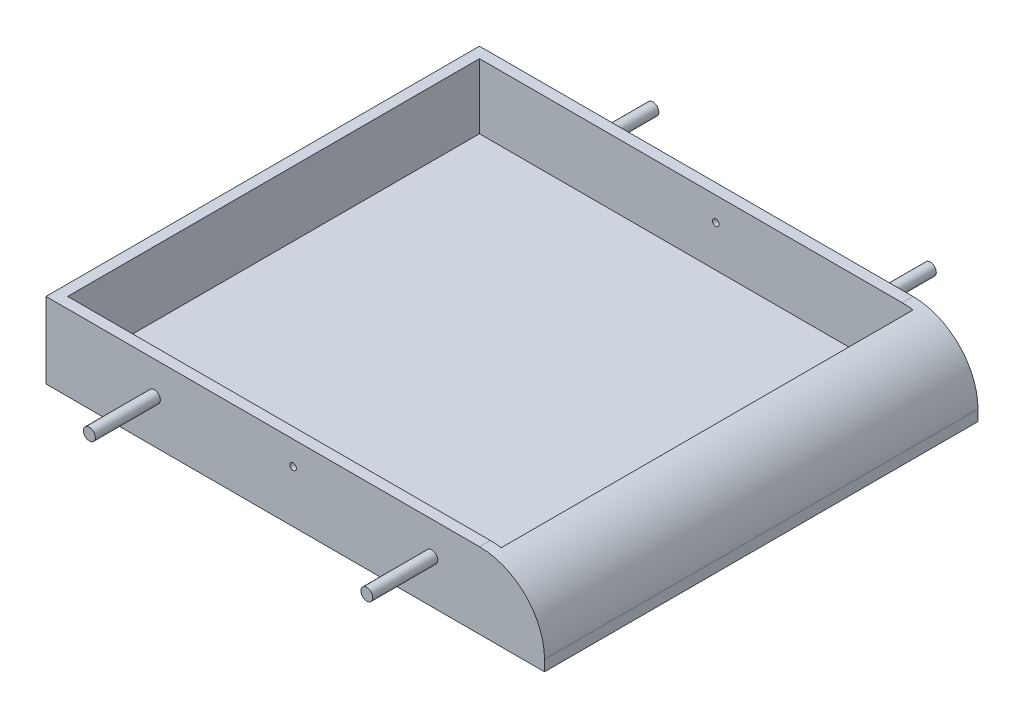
ISO-10303-21;
HEADER;
FILE_DESCRIPTION(('STEP AP214'),'2;1');
FILE_NAME('part.step','',(''),(''),'','','');
FILE_SCHEMA(('AUTOMOTIVE_DESIGN { 1 0 10303 214 1 1 1 1 }'));
ENDSEC;
DATA;
#1=APPLICATION_CONTEXT('core data for automotive mechanical design processes');
#2=APPLICATION_PROTOCOL_DEFINITION('international standard','automotive_design',2000,#1);
#3=PRODUCT_CONTEXT('',#1,'mechanical');
#4=PRODUCT('Part','Part','',(#3));
#5=PRODUCT_RELATED_PRODUCT_CATEGORY('part','',(#4));
#6=PRODUCT_DEFINITION_FORMATION('','',#4);
#7=PRODUCT_DEFINITION_CONTEXT('part definition',#1,'design');
#8=PRODUCT_DEFINITION('design','',#6,#7);
#9=PRODUCT_DEFINITION_SHAPE('','',#8);
#10=(LENGTH_UNIT() NAMED_UNIT(*) SI_UNIT(.MILLI.,.METRE.));
#11=(NAMED_UNIT(*) PLANE_ANGLE_UNIT() SI_UNIT($,.RADIAN.));
#12=(NAMED_UNIT(*) SI_UNIT($,.STERADIAN.) SOLID_ANGLE_UNIT());
#13=UNCERTAINTY_MEASURE_WITH_UNIT(LENGTH_MEASURE(1.E-05),#10,'distance_accuracy_value','');
#14=(GEOMETRIC_REPRESENTATION_CONTEXT(3) GLOBAL_UNCERTAINTY_ASSIGNED_CONTEXT((#13)) GLOBAL_UNIT_ASSIGNED_CONTEXT((#10,
#11,#12)) REPRESENTATION_CONTEXT('',''));
#15=CARTESIAN_POINT('',(0.,0.,0.));
#16=DIRECTION('',(0.,0.,1.));
#17=DIRECTION('',(1.,0.,0.));
#18=AXIS2_PLACEMENT_3D('',#15,#16,#17);
#19=CARTESIAN_POINT('',(-230.,5.,0.));
#20=DIRECTION('',(0.,0.,-1.));
#21=DIRECTION('',(-1.,0.,0.));
#22=AXIS2_PLACEMENT_3D('',#19,#20,#21);
#23=PLANE('',#22);
#24=CARTESIAN_POINT('',(-116.,24.,0.));
#25=DIRECTION('',(0.,0.,-1.));
#26=DIRECTION('',(-1.,0.,0.));
#27=AXIS2_PLACEMENT_3D('',#24,#25,#26);
#28=CIRCLE('',#27,1.5);
#29=CARTESIAN_POINT('',(-117.5,24.,0.));
#30=VERTEX_POINT('',#29);
#31=EDGE_CURVE('E273',#30,#30,#28,.T.);
#32=ORIENTED_EDGE('',*,*,#31,.T.);
#33=EDGE_LOOP('',(#32));
#34=FACE_BOUND('',#33,.T.);
#35=CARTESIAN_POINT('',(-180.,20.,0.));
#36=DIRECTION('',(0.,0.,-1.));
#37=DIRECTION('',(-1.,0.,0.));
#38=AXIS2_PLACEMENT_3D('',#35,#36,#37);
#39=CIRCLE('',#38,2.75000000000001);
#40=CARTESIAN_POINT('',(-182.75,20.,0.));
#41=VERTEX_POINT('',#40);
#42=EDGE_CURVE('E258',#41,#41,#39,.T.);
#43=ORIENTED_EDGE('',*,*,#42,.T.);
#44=EDGE_LOOP('',(#43));
#45=FACE_BOUND('',#44,.T.);
#46=CARTESIAN_POINT('',(-52.,20.,0.));
#47=DIRECTION('',(0.,0.,-1.));
#48=DIRECTION('',(-1.,0.,0.));
#49=AXIS2_PLACEMENT_3D('',#46,#47,#48);
#50=CIRCLE('',#49,2.75);
#51=CARTESIAN_POINT('',(-54.75,20.,0.));
#52=VERTEX_POINT('',#51);
#53=EDGE_CURVE('E163',#52,#52,#50,.T.);
#54=ORIENTED_EDGE('',*,*,#53,.T.);
#55=EDGE_LOOP('',(#54));
#56=FACE_BOUND('',#55,.T.);
#57=DIRECTION('',(0.,-1.,0.));
#58=VECTOR('',#57,1.);
#59=CARTESIAN_POINT('',(0.,5.,0.));
#60=LINE('',#59,#58);
#61=CARTESIAN_POINT('',(0.,5.,0.));
#62=VERTEX_POINT('',#61);
#63=CARTESIAN_POINT('',(0.,0.,0.));
#64=VERTEX_POINT('',#63);
#65=EDGE_CURVE('E214',#62,#64,#60,.T.);
#66=ORIENTED_EDGE('',*,*,#65,.F.);
#67=CARTESIAN_POINT('',(-30.,5.,0.));
#68=DIRECTION('',(0.,0.,-1.));
#69=DIRECTION('',(-1.,0.,0.));
#70=AXIS2_PLACEMENT_3D('',#67,#68,#69);
#71=CIRCLE('',#70,30.);
#72=CARTESIAN_POINT('',(-30.,35.,0.));
#73=VERTEX_POINT('',#72);
#74=EDGE_CURVE('E234',#62,#73,#71,.F.);
#75=ORIENTED_EDGE('',*,*,#74,.T.);
#76=DIRECTION('',(1.,0.,0.));
#77=VECTOR('',#76,1.);
#78=CARTESIAN_POINT('',(-230.,35.,0.));
#79=LINE('',#78,#77);
#80=CARTESIAN_POINT('',(-230.,35.,0.));
#81=VERTEX_POINT('',#80);
#82=EDGE_CURVE('E183',#81,#73,#79,.T.);
#83=ORIENTED_EDGE('',*,*,#82,.F.);
#84=DIRECTION('',(0.,-1.,0.));
#85=VECTOR('',#84,1.);
#86=CARTESIAN_POINT('',(-230.,5.,0.));
#87=LINE('',#86,#85);
#88=CARTESIAN_POINT('',(-230.,0.,0.));
#89=VERTEX_POINT('',#88);
#90=EDGE_CURVE('E204',#81,#89,#87,.T.);
#91=ORIENTED_EDGE('',*,*,#90,.T.);
#92=DIRECTION('',(1.,0.,0.));
#93=VECTOR('',#92,1.);
#94=CARTESIAN_POINT('',(-230.,0.,0.));
#95=LINE('',#94,#93);
#96=EDGE_CURVE('E189',#89,#64,#95,.T.);
#97=ORIENTED_EDGE('',*,*,#96,.T.);
#98=EDGE_LOOP('',(#66,#75,#83,#91,#97));
#99=FACE_BOUND('',#98,.T.);
#100=ADVANCED_FACE('F43',(#34,#45,#56,#99),#23,.F.);
#101=CARTESIAN_POINT('',(0.,5.,-200.));
#102=DIRECTION('',(1.,0.,0.));
#103=DIRECTION('',(0.,0.,-1.));
#104=AXIS2_PLACEMENT_3D('',#101,#102,#103);
#105=PLANE('',#104);
#106=DIRECTION('',(0.,-1.,0.));
#107=VECTOR('',#106,1.);
#108=CARTESIAN_POINT('',(0.,5.,-200.));
#109=LINE('',#108,#107);
#110=CARTESIAN_POINT('',(0.,5.,-200.));
#111=VERTEX_POINT('',#110);
#112=CARTESIAN_POINT('',(0.,0.,-200.));
#113=VERTEX_POINT('',#112);
#114=EDGE_CURVE('E211',#111,#113,#109,.T.);
#115=ORIENTED_EDGE('',*,*,#114,.F.);
#116=DIRECTION('',(0.,0.,-1.));
#117=VECTOR('',#116,1.);
#118=CARTESIAN_POINT('',(0.,5.,-200.));
#119=LINE('',#118,#117);
#120=EDGE_CURVE('E61',#111,#62,#119,.F.);
#121=ORIENTED_EDGE('',*,*,#120,.T.);
#122=ORIENTED_EDGE('',*,*,#65,.T.);
#123=DIRECTION('',(0.,0.,1.));
#124=VECTOR('',#123,1.);
#125=CARTESIAN_POINT('',(0.,0.,-200.));
#126=LINE('',#125,#124);
#127=EDGE_CURVE('E193',#113,#64,#126,.T.);
#128=ORIENTED_EDGE('',*,*,#127,.F.);
#129=EDGE_LOOP('',(#115,#121,#122,#128));
#130=FACE_BOUND('',#129,.T.);
#131=ADVANCED_FACE('F324',(#130),#105,.T.);
#132=CARTESIAN_POINT('',(-230.,5.,-200.));
#133=DIRECTION('',(0.,0.,-1.));
#134=DIRECTION('',(-1.,0.,0.));
#135=AXIS2_PLACEMENT_3D('',#132,#133,#134);
#136=PLANE('',#135);
#137=CARTESIAN_POINT('',(-116.,24.,-200.));
#138=DIRECTION('',(0.,0.,-1.));
#139=DIRECTION('',(-1.,0.,0.));
#140=AXIS2_PLACEMENT_3D('',#137,#138,#139);
#141=CIRCLE('',#140,1.5);
#142=CARTESIAN_POINT('',(-117.5,24.,-200.));
#143=VERTEX_POINT('',#142);
#144=EDGE_CURVE('E277',#143,#143,#141,.T.);
#145=ORIENTED_EDGE('',*,*,#144,.F.);
#146=EDGE_LOOP('',(#145));
#147=FACE_BOUND('',#146,.T.);
#148=CARTESIAN_POINT('',(-180.,20.,-200.));
#149=DIRECTION('',(0.,0.,-1.));
#150=DIRECTION('',(-1.,0.,0.));
#151=AXIS2_PLACEMENT_3D('',#148,#149,#150);
#152=CIRCLE('',#151,2.75000000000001);
#153=CARTESIAN_POINT('',(-182.75,20.,-200.));
#154=VERTEX_POINT('',#153);
#155=EDGE_CURVE('E11',#154,#154,#152,.T.);
#156=ORIENTED_EDGE('',*,*,#155,.F.);
#157=EDGE_LOOP('',(#156));
#158=FACE_BOUND('',#157,.T.);
#159=CARTESIAN_POINT('',(-52.,20.,-200.));
#160=DIRECTION('',(0.,0.,-1.));
#161=DIRECTION('',(-1.,0.,0.));
#162=AXIS2_PLACEMENT_3D('',#159,#160,#161);
#163=CIRCLE('',#162,2.75);
#164=CARTESIAN_POINT('',(-54.75,20.,-200.));
#165=VERTEX_POINT('',#164);
#166=EDGE_CURVE('E53',#165,#165,#163,.T.);
#167=ORIENTED_EDGE('',*,*,#166,.F.);
#168=EDGE_LOOP('',(#167));
#169=FACE_BOUND('',#168,.T.);
#170=DIRECTION('',(-1.,0.,0.));
#171=VECTOR('',#170,1.);
#172=CARTESIAN_POINT('',(-230.,35.,-200.));
#173=LINE('',#172,#171);
#174=CARTESIAN_POINT('',(-30.,35.,-200.));
#175=VERTEX_POINT('',#174);
#176=CARTESIAN_POINT('',(-230.,35.,-200.));
#177=VERTEX_POINT('',#176);
#178=EDGE_CURVE('E186',#175,#177,#173,.T.);
#179=ORIENTED_EDGE('',*,*,#178,.F.);
#180=CARTESIAN_POINT('',(-30.,5.,-200.));
#181=DIRECTION('',(0.,0.,-1.));
#182=DIRECTION('',(-1.,0.,0.));
#183=AXIS2_PLACEMENT_3D('',#180,#181,#182);
#184=CIRCLE('',#183,30.);
#185=EDGE_CURVE('E69',#175,#111,#184,.T.);
#186=ORIENTED_EDGE('',*,*,#185,.T.);
#187=ORIENTED_EDGE('',*,*,#114,.T.);
#188=DIRECTION('',(1.,0.,0.));
#189=VECTOR('',#188,1.);
#190=CARTESIAN_POINT('',(-230.,0.,-200.));
#191=LINE('',#190,#189);
#192=CARTESIAN_POINT('',(-230.,0.,-200.));
#193=VERTEX_POINT('',#192);
#194=EDGE_CURVE('E197',#193,#113,#191,.T.);
#195=ORIENTED_EDGE('',*,*,#194,.F.);
#196=DIRECTION('',(0.,-1.,0.));
#197=VECTOR('',#196,1.);
#198=CARTESIAN_POINT('',(-230.,5.,-200.));
#199=LINE('',#198,#197);
#200=EDGE_CURVE('E208',#177,#193,#199,.T.);
#201=ORIENTED_EDGE('',*,*,#200,.F.);
#202=EDGE_LOOP('',(#179,#186,#187,#195,#201));
#203=FACE_BOUND('',#202,.T.);
#204=ADVANCED_FACE('F307',(#147,#158,#169,#203),#136,.T.);
#205=CARTESIAN_POINT('',(-230.,5.,-200.));
#206=DIRECTION('',(1.,0.,0.));
#207=DIRECTION('',(0.,0.,-1.));
#208=AXIS2_PLACEMENT_3D('',#205,#206,#207);
#209=PLANE('',#208);
#210=DIRECTION('',(0.,0.,1.));
#211=VECTOR('',#210,1.);
#212=CARTESIAN_POINT('',(-230.,0.,-200.));
#213=LINE('',#212,#211);
#214=EDGE_CURVE('E201',#193,#89,#213,.T.);
#215=ORIENTED_EDGE('',*,*,#214,.T.);
#216=ORIENTED_EDGE('',*,*,#90,.F.);
#217=DIRECTION('',(0.,0.,1.));
#218=VECTOR('',#217,1.);
#219=CARTESIAN_POINT('',(-230.,35.,-200.));
#220=LINE('',#219,#218);
#221=EDGE_CURVE('E145',#177,#81,#220,.T.);
#222=ORIENTED_EDGE('',*,*,#221,.F.);
#223=ORIENTED_EDGE('',*,*,#200,.T.);
#224=EDGE_LOOP('',(#215,#216,#222,#223));
#225=FACE_BOUND('',#224,.T.);
#226=ADVANCED_FACE('F312',(#225),#209,.F.);
#227=CARTESIAN_POINT('',(0.,0.,0.));
#228=DIRECTION('',(0.,-1.,0.));
#229=DIRECTION('',(0.,0.,-1.));
#230=AXIS2_PLACEMENT_3D('',#227,#228,#229);
#231=PLANE('',#230);
#232=ORIENTED_EDGE('',*,*,#96,.F.);
#233=ORIENTED_EDGE('',*,*,#214,.F.);
#234=ORIENTED_EDGE('',*,*,#194,.T.);
#235=ORIENTED_EDGE('',*,*,#127,.T.);
#236=EDGE_LOOP('',(#232,#233,#234,#235));
#237=FACE_BOUND('',#236,.T.);
#238=ADVANCED_FACE('F336',(#237),#231,.T.);
#239=CARTESIAN_POINT('',(0.,35.,0.));
#240=DIRECTION('',(0.,1.,0.));
#241=DIRECTION('',(0.,0.,1.));
#242=AXIS2_PLACEMENT_3D('',#239,#240,#241);
#243=PLANE('',#242);
#244=ORIENTED_EDGE('',*,*,#82,.T.);
#245=DIRECTION('',(0.,0.,-1.));
#246=VECTOR('',#245,1.);
#247=CARTESIAN_POINT('',(-30.,35.,0.));
#248=LINE('',#247,#246);
#249=CARTESIAN_POINT('',(-30.,35.,-5.));
#250=VERTEX_POINT('',#249);
#251=EDGE_CURVE('E152',#73,#250,#248,.T.);
#252=ORIENTED_EDGE('',*,*,#251,.T.);
#253=DIRECTION('',(1.,0.,0.));
#254=VECTOR('',#253,1.);
#255=CARTESIAN_POINT('',(-225.,35.,-5.));
#256=LINE('',#255,#254);
#257=CARTESIAN_POINT('',(-225.,35.,-5.));
#258=VERTEX_POINT('',#257);
#259=EDGE_CURVE('E136',#258,#250,#256,.T.);
#260=ORIENTED_EDGE('',*,*,#259,.F.);
#261=DIRECTION('',(0.,0.,1.));
#262=VECTOR('',#261,1.);
#263=CARTESIAN_POINT('',(-225.,35.,-195.));
#264=LINE('',#263,#262);
#265=CARTESIAN_POINT('',(-225.,35.,-195.));
#266=VERTEX_POINT('',#265);
#267=EDGE_CURVE('E125',#266,#258,#264,.T.);
#268=ORIENTED_EDGE('',*,*,#267,.F.);
#269=DIRECTION('',(-1.,0.,0.));
#270=VECTOR('',#269,1.);
#271=CARTESIAN_POINT('',(-225.,35.,-195.));
#272=LINE('',#271,#270);
#273=CARTESIAN_POINT('',(-30.,35.,-195.));
#274=VERTEX_POINT('',#273);
#275=EDGE_CURVE('E154',#274,#266,#272,.T.);
#276=ORIENTED_EDGE('',*,*,#275,.F.);
#277=DIRECTION('',(0.,0.,-1.));
#278=VECTOR('',#277,1.);
#279=CARTESIAN_POINT('',(-30.,35.,0.));
#280=LINE('',#279,#278);
#281=EDGE_CURVE('E217',#274,#175,#280,.T.);
#282=ORIENTED_EDGE('',*,*,#281,.T.);
#283=ORIENTED_EDGE('',*,*,#178,.T.);
#284=ORIENTED_EDGE('',*,*,#221,.T.);
#285=EDGE_LOOP('',(#244,#252,#260,#268,#276,#282,#283,#284));
#286=FACE_BOUND('',#285,.T.);
#287=ADVANCED_FACE('F150',(#286),#243,.T.);
#288=CARTESIAN_POINT('',(-225.,35.,-195.));
#289=DIRECTION('',(1.,0.,0.));
#290=DIRECTION('',(0.,0.,-1.));
#291=AXIS2_PLACEMENT_3D('',#288,#289,#290);
#292=PLANE('',#291);
#293=DIRECTION('',(0.,0.,1.));
#294=VECTOR('',#293,1.);
#295=CARTESIAN_POINT('',(-225.,5.,-195.));
#296=LINE('',#295,#294);
#297=CARTESIAN_POINT('',(-225.,5.,-195.));
#298=VERTEX_POINT('',#297);
#299=CARTESIAN_POINT('',(-225.,5.,-5.));
#300=VERTEX_POINT('',#299);
#301=EDGE_CURVE('E160',#298,#300,#296,.T.);
#302=ORIENTED_EDGE('',*,*,#301,.F.);
#303=DIRECTION('',(0.,-1.,0.));
#304=VECTOR('',#303,1.);
#305=CARTESIAN_POINT('',(-225.,35.,-195.));
#306=LINE('',#305,#304);
#307=EDGE_CURVE('E131',#266,#298,#306,.T.);
#308=ORIENTED_EDGE('',*,*,#307,.F.);
#309=ORIENTED_EDGE('',*,*,#267,.T.);
#310=DIRECTION('',(0.,-1.,0.));
#311=VECTOR('',#310,1.);
#312=CARTESIAN_POINT('',(-225.,35.,-5.));
#313=LINE('',#312,#311);
#314=EDGE_CURVE('E129',#258,#300,#313,.T.);
#315=ORIENTED_EDGE('',*,*,#314,.T.);
#316=EDGE_LOOP('',(#302,#308,#309,#315));
#317=FACE_BOUND('',#316,.T.);
#318=ADVANCED_FACE('F128',(#317),#292,.T.);
#319=CARTESIAN_POINT('',(-225.,35.,-5.));
#320=DIRECTION('',(0.,0.,-1.));
#321=DIRECTION('',(-1.,0.,0.));
#322=AXIS2_PLACEMENT_3D('',#319,#320,#321);
#323=PLANE('',#322);
#324=CARTESIAN_POINT('',(-116.,24.,-5.));
#325=DIRECTION('',(0.,0.,-1.));
#326=DIRECTION('',(-1.,0.,0.));
#327=AXIS2_PLACEMENT_3D('',#324,#325,#326);
#328=CIRCLE('',#327,1.5);
#329=CARTESIAN_POINT('',(-117.5,24.,-5.));
#330=VERTEX_POINT('',#329);
#331=EDGE_CURVE('E281',#330,#330,#328,.T.);
#332=ORIENTED_EDGE('',*,*,#331,.F.);
#333=EDGE_LOOP('',(#332));
#334=FACE_BOUND('',#333,.T.);
#335=ORIENTED_EDGE('',*,*,#259,.T.);
#336=CARTESIAN_POINT('',(-30.,5.,-5.));
#337=DIRECTION('',(0.,0.,-1.));
#338=DIRECTION('',(-1.,0.,0.));
#339=AXIS2_PLACEMENT_3D('',#336,#337,#338);
#340=CIRCLE('',#339,30.);
#341=CARTESIAN_POINT('',(-25.,34.5803989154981,-5.));
#342=VERTEX_POINT('',#341);
#343=EDGE_CURVE('E222',#250,#342,#340,.T.);
#344=ORIENTED_EDGE('',*,*,#343,.T.);
#345=DIRECTION('',(0.,-1.,0.));
#346=VECTOR('',#345,1.);
#347=CARTESIAN_POINT('',(-25.,35.,-5.));
#348=LINE('',#347,#346);
#349=CARTESIAN_POINT('',(-25.,5.,-5.));
#350=VERTEX_POINT('',#349);
#351=EDGE_CURVE('E146',#342,#350,#348,.T.);
#352=ORIENTED_EDGE('',*,*,#351,.T.);
#353=DIRECTION('',(1.,0.,0.));
#354=VECTOR('',#353,1.);
#355=CARTESIAN_POINT('',(-225.,5.,-5.));
#356=LINE('',#355,#354);
#357=EDGE_CURVE('E143',#300,#350,#356,.T.);
#358=ORIENTED_EDGE('',*,*,#357,.F.);
#359=ORIENTED_EDGE('',*,*,#314,.F.);
#360=EDGE_LOOP('',(#335,#344,#352,#358,#359));
#361=FACE_BOUND('',#360,.T.);
#362=ADVANCED_FACE('F141',(#334,#361),#323,.T.);
#363=CARTESIAN_POINT('',(-25.,35.,-195.));
#364=DIRECTION('',(-1.,0.,0.));
#365=DIRECTION('',(0.,0.,1.));
#366=AXIS2_PLACEMENT_3D('',#363,#364,#365);
#367=PLANE('',#366);
#368=ORIENTED_EDGE('',*,*,#351,.F.);
#369=DIRECTION('',(0.,0.,-1.));
#370=VECTOR('',#369,1.);
#371=CARTESIAN_POINT('',(-25.,34.5803989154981,-5.));
#372=LINE('',#371,#370);
#373=CARTESIAN_POINT('',(-25.,34.5803989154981,-195.));
#374=VERTEX_POINT('',#373);
#375=EDGE_CURVE('E225',#342,#374,#372,.T.);
#376=ORIENTED_EDGE('',*,*,#375,.T.);
#377=DIRECTION('',(0.,-1.,0.));
#378=VECTOR('',#377,1.);
#379=CARTESIAN_POINT('',(-25.,35.,-195.));
#380=LINE('',#379,#378);
#381=CARTESIAN_POINT('',(-25.,5.,-195.));
#382=VERTEX_POINT('',#381);
#383=EDGE_CURVE('E175',#374,#382,#380,.T.);
#384=ORIENTED_EDGE('',*,*,#383,.T.);
#385=DIRECTION('',(0.,0.,-1.));
#386=VECTOR('',#385,1.);
#387=CARTESIAN_POINT('',(-25.,5.,-195.));
#388=LINE('',#387,#386);
#389=EDGE_CURVE('E166',#350,#382,#388,.T.);
#390=ORIENTED_EDGE('',*,*,#389,.F.);
#391=EDGE_LOOP('',(#368,#376,#384,#390));
#392=FACE_BOUND('',#391,.T.);
#393=ADVANCED_FACE('F296',(#392),#367,.T.);
#394=CARTESIAN_POINT('',(-225.,35.,-195.));
#395=DIRECTION('',(0.,0.,1.));
#396=DIRECTION('',(1.,0.,0.));
#397=AXIS2_PLACEMENT_3D('',#394,#395,#396);
#398=PLANE('',#397);
#399=CARTESIAN_POINT('',(-116.,24.,-195.));
#400=DIRECTION('',(0.,0.,1.));
#401=DIRECTION('',(1.,0.,0.));
#402=AXIS2_PLACEMENT_3D('',#399,#400,#401);
#403=CIRCLE('',#402,1.5);
#404=CARTESIAN_POINT('',(-117.5,24.,-195.));
#405=VERTEX_POINT('',#404);
#406=EDGE_CURVE('E47',#405,#405,#403,.T.);
#407=ORIENTED_EDGE('',*,*,#406,.F.);
#408=EDGE_LOOP('',(#407));
#409=FACE_BOUND('',#408,.T.);
#410=ORIENTED_EDGE('',*,*,#383,.F.);
#411=CARTESIAN_POINT('',(-30.,5.,-195.));
#412=DIRECTION('',(0.,0.,1.));
#413=DIRECTION('',(1.,0.,0.));
#414=AXIS2_PLACEMENT_3D('',#411,#412,#413);
#415=CIRCLE('',#414,30.);
#416=EDGE_CURVE('E228',#374,#274,#415,.T.);
#417=ORIENTED_EDGE('',*,*,#416,.T.);
#418=ORIENTED_EDGE('',*,*,#275,.T.);
#419=ORIENTED_EDGE('',*,*,#307,.T.);
#420=DIRECTION('',(-1.,0.,0.));
#421=VECTOR('',#420,1.);
#422=CARTESIAN_POINT('',(-225.,5.,-195.));
#423=LINE('',#422,#421);
#424=EDGE_CURVE('E137',#382,#298,#423,.T.);
#425=ORIENTED_EDGE('',*,*,#424,.F.);
#426=EDGE_LOOP('',(#410,#417,#418,#419,#425));
#427=FACE_BOUND('',#426,.T.);
#428=ADVANCED_FACE('F292',(#409,#427),#398,.T.);
#429=CARTESIAN_POINT('',(0.,5.,0.));
#430=DIRECTION('',(0.,-1.,0.));
#431=DIRECTION('',(0.,0.,-1.));
#432=AXIS2_PLACEMENT_3D('',#429,#430,#431);
#433=PLANE('',#432);
#434=ORIENTED_EDGE('',*,*,#424,.T.);
#435=ORIENTED_EDGE('',*,*,#301,.T.);
#436=ORIENTED_EDGE('',*,*,#357,.T.);
#437=ORIENTED_EDGE('',*,*,#389,.T.);
#438=EDGE_LOOP('',(#434,#435,#436,#437));
#439=FACE_BOUND('',#438,.T.);
#440=ADVANCED_FACE('F295',(#439),#433,.F.);
#441=CARTESIAN_POINT('',(-30.,5.,0.));
#442=DIRECTION('',(0.,0.,-1.));
#443=DIRECTION('',(-1.,0.,0.));
#444=AXIS2_PLACEMENT_3D('',#441,#442,#443);
#445=CYLINDRICAL_SURFACE('',#444,30.);
#446=ORIENTED_EDGE('',*,*,#74,.F.);
#447=ORIENTED_EDGE('',*,*,#120,.F.);
#448=ORIENTED_EDGE('',*,*,#185,.F.);
#449=ORIENTED_EDGE('',*,*,#281,.F.);
#450=ORIENTED_EDGE('',*,*,#416,.F.);
#451=ORIENTED_EDGE('',*,*,#375,.F.);
#452=ORIENTED_EDGE('',*,*,#343,.F.);
#453=ORIENTED_EDGE('',*,*,#251,.F.);
#454=EDGE_LOOP('',(#446,#447,#448,#449,#450,#451,#452,#453));
#455=FACE_BOUND('',#454,.T.);
#456=ADVANCED_FACE('F45',(#455),#445,.T.);
#457=CARTESIAN_POINT('',(-52.,20.,-230.));
#458=DIRECTION('',(0.,0.,-1.));
#459=DIRECTION('',(-1.,0.,0.));
#460=AXIS2_PLACEMENT_3D('',#457,#458,#459);
#461=PLANE('',#460);
#462=CARTESIAN_POINT('',(-52.,20.,-230.));
#463=DIRECTION('',(0.,0.,-1.));
#464=DIRECTION('',(-1.,0.,0.));
#465=AXIS2_PLACEMENT_3D('',#462,#463,#464);
#466=CIRCLE('',#465,2.75);
#467=CARTESIAN_POINT('',(-54.75,20.,-230.));
#468=VERTEX_POINT('',#467);
#469=EDGE_CURVE('E253',#468,#468,#466,.T.);
#470=ORIENTED_EDGE('',*,*,#469,.T.);
#471=EDGE_LOOP('',(#470));
#472=FACE_BOUND('',#471,.T.);
#473=ADVANCED_FACE('F320',(#472),#461,.T.);
#474=CARTESIAN_POINT('',(-52.,20.,30.));
#475=DIRECTION('',(0.,0.,-1.));
#476=DIRECTION('',(-1.,0.,0.));
#477=AXIS2_PLACEMENT_3D('',#474,#475,#476);
#478=CYLINDRICAL_SURFACE('',#477,2.75);
#479=ORIENTED_EDGE('',*,*,#166,.T.);
#480=EDGE_LOOP('',(#479));
#481=FACE_BOUND('',#480,.T.);
#482=ORIENTED_EDGE('',*,*,#469,.F.);
#483=EDGE_LOOP('',(#482));
#484=FACE_BOUND('',#483,.T.);
#485=ADVANCED_FACE('F358',(#481,#484),#478,.T.);
#486=CARTESIAN_POINT('',(-52.,20.,30.));
#487=DIRECTION('',(0.,0.,-1.));
#488=DIRECTION('',(-1.,0.,0.));
#489=AXIS2_PLACEMENT_3D('',#486,#487,#488);
#490=CIRCLE('',#489,2.75);
#491=CARTESIAN_POINT('',(-54.75,20.,30.));
#492=VERTEX_POINT('',#491);
#493=EDGE_CURVE('E245',#492,#492,#490,.T.);
#494=ORIENTED_EDGE('',*,*,#493,.T.);
#495=EDGE_LOOP('',(#494));
#496=FACE_BOUND('',#495,.T.);
#497=ORIENTED_EDGE('',*,*,#53,.F.);
#498=EDGE_LOOP('',(#497));
#499=FACE_BOUND('',#498,.T.);
#500=ADVANCED_FACE('F354',(#496,#499),#478,.T.);
#501=CARTESIAN_POINT('',(-52.,20.,30.));
#502=DIRECTION('',(0.,0.,-1.));
#503=DIRECTION('',(-1.,0.,0.));
#504=AXIS2_PLACEMENT_3D('',#501,#502,#503);
#505=PLANE('',#504);
#506=ORIENTED_EDGE('',*,*,#493,.F.);
#507=EDGE_LOOP('',(#506));
#508=FACE_BOUND('',#507,.T.);
#509=ADVANCED_FACE('F357',(#508),#505,.F.);
#510=CARTESIAN_POINT('',(-180.,20.,-230.));
#511=DIRECTION('',(0.,0.,-1.));
#512=DIRECTION('',(-1.,0.,0.));
#513=AXIS2_PLACEMENT_3D('',#510,#511,#512);
#514=PLANE('',#513);
#515=CARTESIAN_POINT('',(-180.,20.,-230.));
#516=DIRECTION('',(0.,0.,-1.));
#517=DIRECTION('',(-1.,0.,0.));
#518=AXIS2_PLACEMENT_3D('',#515,#516,#517);
#519=CIRCLE('',#518,2.75000000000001);
#520=CARTESIAN_POINT('',(-182.75,20.,-230.));
#521=VERTEX_POINT('',#520);
#522=EDGE_CURVE('E263',#521,#521,#519,.T.);
#523=ORIENTED_EDGE('',*,*,#522,.T.);
#524=EDGE_LOOP('',(#523));
#525=FACE_BOUND('',#524,.T.);
#526=ADVANCED_FACE('F361',(#525),#514,.T.);
#527=CARTESIAN_POINT('',(-180.,20.,30.));
#528=DIRECTION('',(0.,0.,-1.));
#529=DIRECTION('',(-1.,0.,0.));
#530=AXIS2_PLACEMENT_3D('',#527,#528,#529);
#531=CYLINDRICAL_SURFACE('',#530,2.75000000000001);
#532=ORIENTED_EDGE('',*,*,#155,.T.);
#533=EDGE_LOOP('',(#532));
#534=FACE_BOUND('',#533,.T.);
#535=ORIENTED_EDGE('',*,*,#522,.F.);
#536=EDGE_LOOP('',(#535));
#537=FACE_BOUND('',#536,.T.);
#538=ADVANCED_FACE('F367',(#534,#537),#531,.T.);
#539=CARTESIAN_POINT('',(-180.,20.,30.));
#540=DIRECTION('',(0.,0.,-1.));
#541=DIRECTION('',(-1.,0.,0.));
#542=AXIS2_PLACEMENT_3D('',#539,#540,#541);
#543=CIRCLE('',#542,2.75000000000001);
#544=CARTESIAN_POINT('',(-182.75,20.,30.));
#545=VERTEX_POINT('',#544);
#546=EDGE_CURVE('E269',#545,#545,#543,.T.);
#547=ORIENTED_EDGE('',*,*,#546,.T.);
#548=EDGE_LOOP('',(#547));
#549=FACE_BOUND('',#548,.T.);
#550=ORIENTED_EDGE('',*,*,#42,.F.);
#551=EDGE_LOOP('',(#550));
#552=FACE_BOUND('',#551,.T.);
#553=ADVANCED_FACE('F372',(#549,#552),#531,.T.);
#554=CARTESIAN_POINT('',(-180.,20.,30.));
#555=DIRECTION('',(0.,0.,-1.));
#556=DIRECTION('',(-1.,0.,0.));
#557=AXIS2_PLACEMENT_3D('',#554,#555,#556);
#558=PLANE('',#557);
#559=ORIENTED_EDGE('',*,*,#546,.F.);
#560=EDGE_LOOP('',(#559));
#561=FACE_BOUND('',#560,.T.);
#562=ADVANCED_FACE('F369',(#561),#558,.F.);
#563=CARTESIAN_POINT('',(-116.,24.,30.));
#564=DIRECTION('',(0.,0.,-1.));
#565=DIRECTION('',(-1.,0.,0.));
#566=AXIS2_PLACEMENT_3D('',#563,#564,#565);
#567=CYLINDRICAL_SURFACE('',#566,1.5);
#568=CARTESIAN_POINT('',(-117.5,24.,-200.));
#569=CARTESIAN_POINT('',(-117.5,24.,-199.947916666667));
#570=CARTESIAN_POINT('',(-117.5,24.,-199.895833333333));
#571=CARTESIAN_POINT('',(-117.5,24.,-199.791666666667));
#572=CARTESIAN_POINT('',(-117.5,24.,-199.739583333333));
#573=CARTESIAN_POINT('',(-117.5,24.,-199.635416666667));
#574=CARTESIAN_POINT('',(-117.5,24.,-199.583333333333));
#575=CARTESIAN_POINT('',(-117.5,24.,-199.479166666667));
#576=CARTESIAN_POINT('',(-117.5,24.,-199.427083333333));
#577=CARTESIAN_POINT('',(-117.5,24.,-199.322916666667));
#578=CARTESIAN_POINT('',(-117.5,24.,-199.270833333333));
#579=CARTESIAN_POINT('',(-117.5,24.,-199.166666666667));
#580=CARTESIAN_POINT('',(-117.5,24.,-199.114583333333));
#581=CARTESIAN_POINT('',(-117.5,24.,-199.010416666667));
#582=CARTESIAN_POINT('',(-117.5,24.,-198.958333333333));
#583=CARTESIAN_POINT('',(-117.5,24.,-198.854166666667));
#584=CARTESIAN_POINT('',(-117.5,24.,-198.802083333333));
#585=CARTESIAN_POINT('',(-117.5,24.,-198.697916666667));
#586=CARTESIAN_POINT('',(-117.5,24.,-198.645833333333));
#587=CARTESIAN_POINT('',(-117.5,24.,-198.541666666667));
#588=CARTESIAN_POINT('',(-117.5,24.,-198.489583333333));
#589=CARTESIAN_POINT('',(-117.5,24.,-198.385416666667));
#590=CARTESIAN_POINT('',(-117.5,24.,-198.333333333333));
#591=CARTESIAN_POINT('',(-117.5,24.,-198.229166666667));
#592=CARTESIAN_POINT('',(-117.5,24.,-198.177083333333));
#593=CARTESIAN_POINT('',(-117.5,24.,-198.072916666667));
#594=CARTESIAN_POINT('',(-117.5,24.,-198.020833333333));
#595=CARTESIAN_POINT('',(-117.5,24.,-197.916666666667));
#596=CARTESIAN_POINT('',(-117.5,24.,-197.864583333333));
#597=CARTESIAN_POINT('',(-117.5,24.,-197.760416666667));
#598=CARTESIAN_POINT('',(-117.5,24.,-197.708333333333));
#599=CARTESIAN_POINT('',(-117.5,24.,-197.604166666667));
#600=CARTESIAN_POINT('',(-117.5,24.,-197.552083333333));
#601=CARTESIAN_POINT('',(-117.5,24.,-197.447916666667));
#602=CARTESIAN_POINT('',(-117.5,24.,-197.395833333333));
#603=CARTESIAN_POINT('',(-117.5,24.,-197.291666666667));
#604=CARTESIAN_POINT('',(-117.5,24.,-197.239583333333));
#605=CARTESIAN_POINT('',(-117.5,24.,-197.135416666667));
#606=CARTESIAN_POINT('',(-117.5,24.,-197.083333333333));
#607=CARTESIAN_POINT('',(-117.5,24.,-196.979166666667));
#608=CARTESIAN_POINT('',(-117.5,24.,-196.927083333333));
#609=CARTESIAN_POINT('',(-117.5,24.,-196.822916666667));
#610=CARTESIAN_POINT('',(-117.5,24.,-196.770833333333));
#611=CARTESIAN_POINT('',(-117.5,24.,-196.666666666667));
#612=CARTESIAN_POINT('',(-117.5,24.,-196.614583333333));
#613=CARTESIAN_POINT('',(-117.5,24.,-196.510416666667));
#614=CARTESIAN_POINT('',(-117.5,24.,-196.458333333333));
#615=CARTESIAN_POINT('',(-117.5,24.,-196.354166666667));
#616=CARTESIAN_POINT('',(-117.5,24.,-196.302083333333));
#617=CARTESIAN_POINT('',(-117.5,24.,-196.197916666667));
#618=CARTESIAN_POINT('',(-117.5,24.,-196.145833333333));
#619=CARTESIAN_POINT('',(-117.5,24.,-196.041666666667));
#620=CARTESIAN_POINT('',(-117.5,24.,-195.989583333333));
#621=CARTESIAN_POINT('',(-117.5,24.,-195.885416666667));
#622=CARTESIAN_POINT('',(-117.5,24.,-195.833333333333));
#623=CARTESIAN_POINT('',(-117.5,24.,-195.729166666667));
#624=CARTESIAN_POINT('',(-117.5,24.,-195.677083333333));
#625=CARTESIAN_POINT('',(-117.5,24.,-195.572916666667));
#626=CARTESIAN_POINT('',(-117.5,24.,-195.520833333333));
#627=CARTESIAN_POINT('',(-117.5,24.,-195.416666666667));
#628=CARTESIAN_POINT('',(-117.5,24.,-195.364583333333));
#629=CARTESIAN_POINT('',(-117.5,24.,-195.260416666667));
#630=CARTESIAN_POINT('',(-117.5,24.,-195.208333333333));
#631=CARTESIAN_POINT('',(-117.5,24.,-195.104166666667));
#632=CARTESIAN_POINT('',(-117.5,24.,-195.052083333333));
#633=CARTESIAN_POINT('',(-117.5,24.,-195.));
#634=B_SPLINE_CURVE_WITH_KNOTS('',3,(#568,#569,#570,#571,#572,#573,#574,#575,#576,#577,#578,
#579,#580,#581,#582,#583,#584,#585,#586,#587,#588,#589,#590,#591,#592,#593,#594,#595,#596,#597,
#598,#599,#600,#601,#602,#603,#604,#605,#606,#607,#608,#609,#610,#611,#612,#613,#614,#615,#616,
#617,#618,#619,#620,#621,#622,#623,#624,#625,#626,#627,#628,#629,#630,#631,#632,#633),
.UNSPECIFIED.,.F.,.F.,(4,2,2,2,2,2,2,2,2,2,2,2,2,2,2,2,2,2,2,2,2,2,2,2,2,2,2,2,2,2,2,2,4),(0.,
0.156249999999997,0.312499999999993,0.46874999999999,0.624999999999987,0.781250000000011,
0.937500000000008,1.09375,1.25,1.40625,1.56249999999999,1.71874999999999,1.87500000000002,
2.03125000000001,2.18750000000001,2.34375000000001,2.5,2.65625,2.8125,2.96874999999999,
3.12499999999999,3.28125000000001,3.43750000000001,3.59375000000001,3.75,3.90625,4.0625,
4.21874999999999,4.37500000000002,4.53125000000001,4.68750000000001,4.84375000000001,5.),.UNSPECIFIED.);
#635=EDGE_CURVE('BSEAM290',#143,#405,#634,.T.);
#636=ORIENTED_EDGE('',*,*,#144,.T.);
#637=ORIENTED_EDGE('',*,*,#406,.T.);
#638=ORIENTED_EDGE('',*,*,#635,.T.);
#639=ORIENTED_EDGE('',*,*,#635,.F.);
#640=EDGE_LOOP('',(#636,#638,#637,#639));
#641=FACE_BOUND('',#640,.T.);
#642=ADVANCED_FACE('F290',(#641),#567,.F.);
#643=CARTESIAN_POINT('',(-117.5,24.,-5.));
#644=CARTESIAN_POINT('',(-117.5,24.,-4.94791666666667));
#645=CARTESIAN_POINT('',(-117.5,24.,-4.89583333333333));
#646=CARTESIAN_POINT('',(-117.5,24.,-4.79166666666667));
#647=CARTESIAN_POINT('',(-117.5,24.,-4.73958333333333));
#648=CARTESIAN_POINT('',(-117.5,24.,-4.63541666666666));
#649=CARTESIAN_POINT('',(-117.5,24.,-4.58333333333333));
#650=CARTESIAN_POINT('',(-117.5,24.,-4.47916666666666));
#651=CARTESIAN_POINT('',(-117.5,24.,-4.42708333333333));
#652=CARTESIAN_POINT('',(-117.5,24.,-4.32291666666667));
#653=CARTESIAN_POINT('',(-117.5,24.,-4.27083333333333));
#654=CARTESIAN_POINT('',(-117.5,24.,-4.16666666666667));
#655=CARTESIAN_POINT('',(-117.5,24.,-4.11458333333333));
#656=CARTESIAN_POINT('',(-117.5,24.,-4.01041666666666));
#657=CARTESIAN_POINT('',(-117.5,24.,-3.95833333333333));
#658=CARTESIAN_POINT('',(-117.5,24.,-3.85416666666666));
#659=CARTESIAN_POINT('',(-117.5,24.,-3.80208333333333));
#660=CARTESIAN_POINT('',(-117.5,24.,-3.69791666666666));
#661=CARTESIAN_POINT('',(-117.5,24.,-3.64583333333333));
#662=CARTESIAN_POINT('',(-117.5,24.,-3.54166666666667));
#663=CARTESIAN_POINT('',(-117.5,24.,-3.48958333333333));
#664=CARTESIAN_POINT('',(-117.5,24.,-3.38541666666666));
#665=CARTESIAN_POINT('',(-117.5,24.,-3.33333333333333));
#666=CARTESIAN_POINT('',(-117.5,24.,-3.22916666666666));
#667=CARTESIAN_POINT('',(-117.5,24.,-3.17708333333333));
#668=CARTESIAN_POINT('',(-117.5,24.,-3.07291666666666));
#669=CARTESIAN_POINT('',(-117.5,24.,-3.02083333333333));
#670=CARTESIAN_POINT('',(-117.5,24.,-2.91666666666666));
#671=CARTESIAN_POINT('',(-117.5,24.,-2.86458333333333));
#672=CARTESIAN_POINT('',(-117.5,24.,-2.76041666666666));
#673=CARTESIAN_POINT('',(-117.5,24.,-2.70833333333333));
#674=CARTESIAN_POINT('',(-117.5,24.,-2.60416666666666));
#675=CARTESIAN_POINT('',(-117.5,24.,-2.55208333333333));
#676=CARTESIAN_POINT('',(-117.5,24.,-2.44791666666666));
#677=CARTESIAN_POINT('',(-117.5,24.,-2.39583333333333));
#678=CARTESIAN_POINT('',(-117.5,24.,-2.29166666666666));
#679=CARTESIAN_POINT('',(-117.5,24.,-2.23958333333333));
#680=CARTESIAN_POINT('',(-117.5,24.,-2.13541666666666));
#681=CARTESIAN_POINT('',(-117.5,24.,-2.08333333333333));
#682=CARTESIAN_POINT('',(-117.5,24.,-1.97916666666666));
#683=CARTESIAN_POINT('',(-117.5,24.,-1.92708333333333));
#684=CARTESIAN_POINT('',(-117.5,24.,-1.82291666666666));
#685=CARTESIAN_POINT('',(-117.5,24.,-1.77083333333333));
#686=CARTESIAN_POINT('',(-117.5,24.,-1.66666666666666));
#687=CARTESIAN_POINT('',(-117.5,24.,-1.61458333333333));
#688=CARTESIAN_POINT('',(-117.5,24.,-1.51041666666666));
#689=CARTESIAN_POINT('',(-117.5,24.,-1.45833333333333));
#690=CARTESIAN_POINT('',(-117.5,24.,-1.35416666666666));
#691=CARTESIAN_POINT('',(-117.5,24.,-1.30208333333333));
#692=CARTESIAN_POINT('',(-117.5,24.,-1.19791666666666));
#693=CARTESIAN_POINT('',(-117.5,24.,-1.14583333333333));
#694=CARTESIAN_POINT('',(-117.5,24.,-1.04166666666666));
#695=CARTESIAN_POINT('',(-117.5,24.,-0.989583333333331));
#696=CARTESIAN_POINT('',(-117.5,24.,-0.885416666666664));
#697=CARTESIAN_POINT('',(-117.5,24.,-0.833333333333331));
#698=CARTESIAN_POINT('',(-117.5,24.,-0.729166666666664));
#699=CARTESIAN_POINT('',(-117.5,24.,-0.67708333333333));
#700=CARTESIAN_POINT('',(-117.5,24.,-0.572916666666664));
#701=CARTESIAN_POINT('',(-117.5,24.,-0.52083333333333));
#702=CARTESIAN_POINT('',(-117.5,24.,-0.416666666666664));
#703=CARTESIAN_POINT('',(-117.5,24.,-0.36458333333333));
#704=CARTESIAN_POINT('',(-117.5,24.,-0.260416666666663));
#705=CARTESIAN_POINT('',(-117.5,24.,-0.20833333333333));
#706=CARTESIAN_POINT('',(-117.5,24.,-0.104166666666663));
#707=CARTESIAN_POINT('',(-117.5,24.,-0.05208333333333));
#708=CARTESIAN_POINT('',(-117.5,24.,0.));
#709=B_SPLINE_CURVE_WITH_KNOTS('',3,(#643,#644,#645,#646,#647,#648,#649,#650,#651,#652,#653,
#654,#655,#656,#657,#658,#659,#660,#661,#662,#663,#664,#665,#666,#667,#668,#669,#670,#671,#672,
#673,#674,#675,#676,#677,#678,#679,#680,#681,#682,#683,#684,#685,#686,#687,#688,#689,#690,#691,
#692,#693,#694,#695,#696,#697,#698,#699,#700,#701,#702,#703,#704,#705,#706,#707,#708),
.UNSPECIFIED.,.F.,.F.,(4,2,2,2,2,2,2,2,2,2,2,2,2,2,2,2,2,2,2,2,2,2,2,2,2,2,2,2,2,2,2,2,4),(0.,
0.156249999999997,0.3125,0.468750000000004,0.625000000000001,0.781249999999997,
0.937500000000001,1.09375,1.25,1.40625,1.5625,1.71875,1.875,2.03125,2.1875,2.34375000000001,2.5,
2.65625,2.8125,2.96875000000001,3.125,3.28125,3.4375,3.59375000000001,3.75,3.90625,4.0625,
4.21875,4.375,4.53125,4.6875,4.84375,5.),.UNSPECIFIED.);
#710=EDGE_CURVE('BSEAM378',#330,#30,#709,.T.);
#711=ORIENTED_EDGE('',*,*,#331,.T.);
#712=ORIENTED_EDGE('',*,*,#31,.F.);
#713=ORIENTED_EDGE('',*,*,#710,.T.);
#714=ORIENTED_EDGE('',*,*,#710,.F.);
#715=EDGE_LOOP('',(#711,#713,#712,#714));
#716=FACE_BOUND('',#715,.T.);
#717=ADVANCED_FACE('F378',(#716),#567,.F.);
#718=CLOSED_SHELL('',(#100,#131,#204,#226,#238,#287,#318,#362,#393,#428,#440,#456,#473,#485,
#500,#509,#526,#538,#553,#562,#642,#717));
#719=MANIFOLD_SOLID_BREP('B2',#718);
#720=ADVANCED_BREP_SHAPE_REPRESENTATION('',(#18,#719),#14);
#721=SHAPE_DEFINITION_REPRESENTATION(#9,#720);
ENDSEC;
END-ISO-10303-21;
